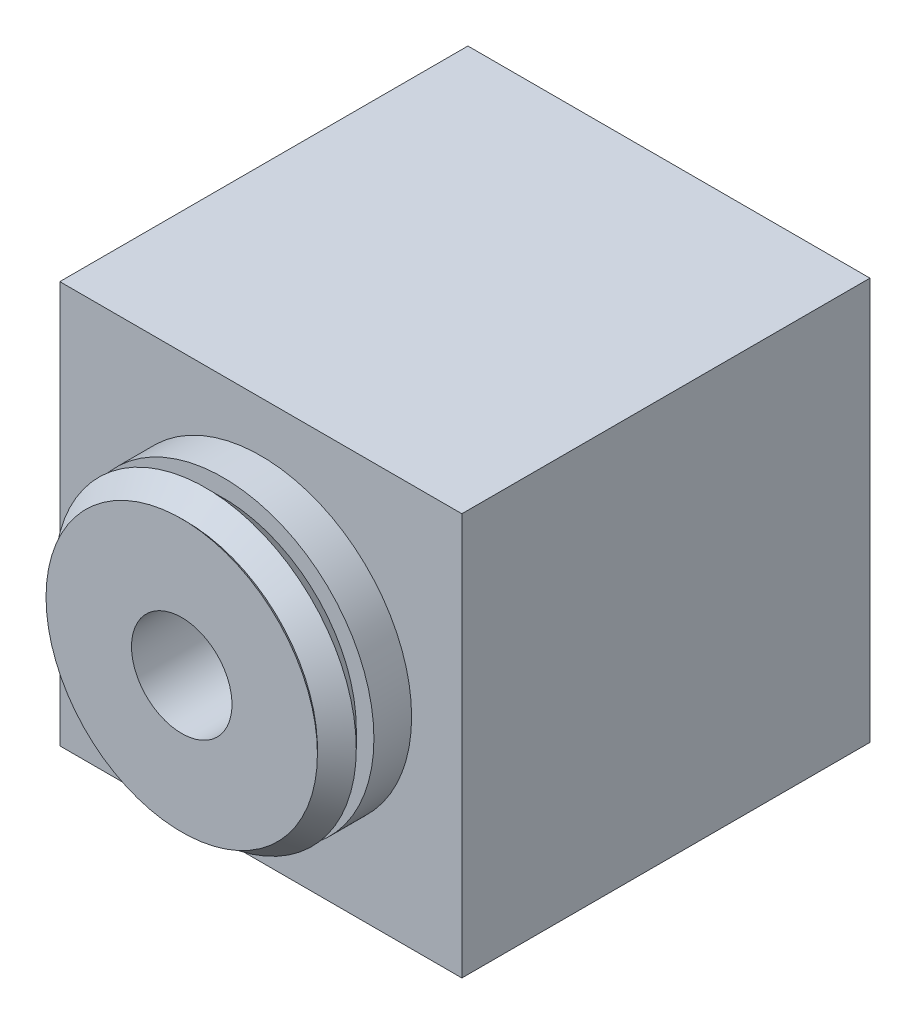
ISO-10303-21;
HEADER;
FILE_DESCRIPTION(('STEP AP214'),'2;1');
FILE_NAME('part.step','',(''),(''),'','','');
FILE_SCHEMA(('AUTOMOTIVE_DESIGN { 1 0 10303 214 1 1 1 1 }'));
ENDSEC;
DATA;
#1=APPLICATION_CONTEXT('core data for automotive mechanical design processes');
#2=APPLICATION_PROTOCOL_DEFINITION('international standard','automotive_design',2000,#1);
#3=PRODUCT_CONTEXT('',#1,'mechanical');
#4=PRODUCT('Part','Part','',(#3));
#5=PRODUCT_RELATED_PRODUCT_CATEGORY('part','',(#4));
#6=PRODUCT_DEFINITION_FORMATION('','',#4);
#7=PRODUCT_DEFINITION_CONTEXT('part definition',#1,'design');
#8=PRODUCT_DEFINITION('design','',#6,#7);
#9=PRODUCT_DEFINITION_SHAPE('','',#8);
#10=(LENGTH_UNIT() NAMED_UNIT(*) SI_UNIT(.MILLI.,.METRE.));
#11=(NAMED_UNIT(*) PLANE_ANGLE_UNIT() SI_UNIT($,.RADIAN.));
#12=(NAMED_UNIT(*) SI_UNIT($,.STERADIAN.) SOLID_ANGLE_UNIT());
#13=UNCERTAINTY_MEASURE_WITH_UNIT(LENGTH_MEASURE(1.E-05),#10,'distance_accuracy_value','');
#14=(GEOMETRIC_REPRESENTATION_CONTEXT(3) GLOBAL_UNCERTAINTY_ASSIGNED_CONTEXT((#13)) GLOBAL_UNIT_ASSIGNED_CONTEXT((#10,
#11,#12)) REPRESENTATION_CONTEXT('',''));
#15=CARTESIAN_POINT('',(0.,0.,0.));
#16=DIRECTION('',(0.,0.,1.));
#17=DIRECTION('',(1.,0.,0.));
#18=AXIS2_PLACEMENT_3D('',#15,#16,#17);
#19=CARTESIAN_POINT('',(0.,0.,0.));
#20=DIRECTION('',(0.,0.,1.));
#21=DIRECTION('',(1.,0.,0.));
#22=AXIS2_PLACEMENT_3D('',#19,#20,#21);
#23=PLANE('',#22);
#24=CARTESIAN_POINT('',(0.,0.,0.));
#25=DIRECTION('',(0.,0.,-1.));
#26=DIRECTION('',(-1.,0.,0.));
#27=AXIS2_PLACEMENT_3D('',#24,#25,#26);
#28=CIRCLE('',#27,6.858);
#29=CARTESIAN_POINT('',(-6.858,0.,0.));
#30=VERTEX_POINT('',#29);
#31=EDGE_CURVE('E11',#30,#30,#28,.T.);
#32=ORIENTED_EDGE('',*,*,#31,.F.);
#33=EDGE_LOOP('',(#32));
#34=FACE_BOUND('',#33,.T.);
#35=CARTESIAN_POINT('',(0.,0.,0.));
#36=DIRECTION('',(0.,0.,-1.));
#37=DIRECTION('',(-1.,0.,0.));
#38=AXIS2_PLACEMENT_3D('',#35,#36,#37);
#39=CIRCLE('',#38,2.54);
#40=CARTESIAN_POINT('',(-2.54,0.,0.));
#41=VERTEX_POINT('',#40);
#42=EDGE_CURVE('E152',#41,#41,#39,.T.);
#43=ORIENTED_EDGE('',*,*,#42,.T.);
#44=EDGE_LOOP('',(#43));
#45=FACE_BOUND('',#44,.T.);
#46=ADVANCED_FACE('F35',(#34,#45),#23,.T.);
#47=CARTESIAN_POINT('',(0.,0.,-26.197814));
#48=DIRECTION('',(0.,0.,-1.));
#49=DIRECTION('',(-1.,0.,0.));
#50=AXIS2_PLACEMENT_3D('',#47,#48,#49);
#51=PLANE('',#50);
#52=CARTESIAN_POINT('',(0.,0.,-26.197814));
#53=DIRECTION('',(0.,0.,-1.));
#54=DIRECTION('',(-1.,0.,0.));
#55=AXIS2_PLACEMENT_3D('',#52,#53,#54);
#56=CIRCLE('',#55,6.35);
#57=CARTESIAN_POINT('',(-6.35,0.,-26.197814));
#58=VERTEX_POINT('',#57);
#59=EDGE_CURVE('E160',#58,#58,#56,.T.);
#60=ORIENTED_EDGE('',*,*,#59,.T.);
#61=EDGE_LOOP('',(#60));
#62=FACE_BOUND('',#61,.T.);
#63=CARTESIAN_POINT('',(0.,0.,-26.197814));
#64=DIRECTION('',(0.,0.,-1.));
#65=DIRECTION('',(-1.,0.,0.));
#66=AXIS2_PLACEMENT_3D('',#63,#64,#65);
#67=CIRCLE('',#66,2.54);
#68=CARTESIAN_POINT('',(-2.54,0.,-26.197814));
#69=VERTEX_POINT('',#68);
#70=EDGE_CURVE('E154',#69,#69,#67,.T.);
#71=ORIENTED_EDGE('',*,*,#70,.F.);
#72=EDGE_LOOP('',(#71));
#73=FACE_BOUND('',#72,.T.);
#74=ADVANCED_FACE('F139',(#62,#73),#51,.T.);
#75=CARTESIAN_POINT('',(10.16,-10.16,-24.623014));
#76=DIRECTION('',(0.,0.,-1.));
#77=DIRECTION('',(-1.,0.,0.));
#78=AXIS2_PLACEMENT_3D('',#75,#76,#77);
#79=PLANE('',#78);
#80=DIRECTION('',(0.,-1.,0.));
#81=VECTOR('',#80,1.);
#82=CARTESIAN_POINT('',(10.16,10.16,-24.623014));
#83=LINE('',#82,#81);
#84=CARTESIAN_POINT('',(10.16,10.16,-24.623014));
#85=VERTEX_POINT('',#84);
#86=CARTESIAN_POINT('',(10.16,-10.16,-24.623014));
#87=VERTEX_POINT('',#86);
#88=EDGE_CURVE('E88',#85,#87,#83,.T.);
#89=ORIENTED_EDGE('',*,*,#88,.T.);
#90=DIRECTION('',(-1.,0.,0.));
#91=VECTOR('',#90,1.);
#92=CARTESIAN_POINT('',(10.16,-10.16,-24.623014));
#93=LINE('',#92,#91);
#94=CARTESIAN_POINT('',(-10.16,-10.16,-24.623014));
#95=VERTEX_POINT('',#94);
#96=EDGE_CURVE('E82',#87,#95,#93,.T.);
#97=ORIENTED_EDGE('',*,*,#96,.T.);
#98=DIRECTION('',(0.,1.,0.));
#99=VECTOR('',#98,1.);
#100=CARTESIAN_POINT('',(-10.16,10.16,-24.623014));
#101=LINE('',#100,#99);
#102=CARTESIAN_POINT('',(-10.16,10.16,-24.623014));
#103=VERTEX_POINT('',#102);
#104=EDGE_CURVE('E86',#95,#103,#101,.T.);
#105=ORIENTED_EDGE('',*,*,#104,.T.);
#106=DIRECTION('',(1.,0.,0.));
#107=VECTOR('',#106,1.);
#108=CARTESIAN_POINT('',(10.16,10.16,-24.623014));
#109=LINE('',#108,#107);
#110=EDGE_CURVE('E51',#103,#85,#109,.T.);
#111=ORIENTED_EDGE('',*,*,#110,.T.);
#112=EDGE_LOOP('',(#89,#97,#105,#111));
#113=FACE_BOUND('',#112,.T.);
#114=CARTESIAN_POINT('',(-6.91950784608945,6.55087633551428,-24.623014));
#115=DIRECTION('',(0.,0.,-1.));
#116=DIRECTION('',(-1.,0.,0.));
#117=AXIS2_PLACEMENT_3D('',#114,#115,#116);
#118=CIRCLE('',#117,1.7272);
#119=CARTESIAN_POINT('',(-8.64670784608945,6.55087633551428,-24.623014));
#120=VERTEX_POINT('',#119);
#121=EDGE_CURVE('E181',#120,#120,#118,.T.);
#122=ORIENTED_EDGE('',*,*,#121,.F.);
#123=EDGE_LOOP('',(#122));
#124=FACE_BOUND('',#123,.T.);
#125=CARTESIAN_POINT('',(6.55087633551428,-6.91950784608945,-24.623014));
#126=DIRECTION('',(0.,0.,-1.));
#127=DIRECTION('',(1.,0.,0.));
#128=AXIS2_PLACEMENT_3D('',#125,#126,#127);
#129=CIRCLE('',#128,1.7272);
#130=CARTESIAN_POINT('',(8.27807633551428,-6.91950784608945,-24.623014));
#131=VERTEX_POINT('',#130);
#132=EDGE_CURVE('E175',#131,#131,#129,.T.);
#133=ORIENTED_EDGE('',*,*,#132,.F.);
#134=EDGE_LOOP('',(#133));
#135=FACE_BOUND('',#134,.T.);
#136=CARTESIAN_POINT('',(0.,0.,-24.623014));
#137=DIRECTION('',(0.,0.,-1.));
#138=DIRECTION('',(-1.,0.,0.));
#139=AXIS2_PLACEMENT_3D('',#136,#137,#138);
#140=CIRCLE('',#139,6.35);
#141=CARTESIAN_POINT('',(-6.35,0.,-24.623014));
#142=VERTEX_POINT('',#141);
#143=EDGE_CURVE('E157',#142,#142,#140,.T.);
#144=ORIENTED_EDGE('',*,*,#143,.F.);
#145=EDGE_LOOP('',(#144));
#146=FACE_BOUND('',#145,.T.);
#147=ADVANCED_FACE('F83',(#113,#124,#135,#146),#79,.T.);
#148=CARTESIAN_POINT('',(0.,0.,-0.219709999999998));
#149=DIRECTION('',(0.,0.,1.));
#150=DIRECTION('',(1.,0.,0.));
#151=AXIS2_PLACEMENT_3D('',#148,#149,#150);
#152=CONICAL_SURFACE('',#151,6.63829,0.785398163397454);
#153=ORIENTED_EDGE('',*,*,#31,.T.);
#154=EDGE_LOOP('',(#153));
#155=FACE_BOUND('',#154,.T.);
#156=CARTESIAN_POINT('',(0.,0.,-0.219709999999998));
#157=DIRECTION('',(0.,0.,-1.));
#158=DIRECTION('',(-1.,0.,0.));
#159=AXIS2_PLACEMENT_3D('',#156,#157,#158);
#160=CIRCLE('',#159,6.63829);
#161=CARTESIAN_POINT('',(-6.63829,0.,-0.219709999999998));
#162=VERTEX_POINT('',#161);
#163=EDGE_CURVE('E43',#162,#162,#160,.T.);
#164=ORIENTED_EDGE('',*,*,#163,.F.);
#165=EDGE_LOOP('',(#164));
#166=FACE_BOUND('',#165,.T.);
#167=ADVANCED_FACE('F130',(#155,#166),#152,.T.);
#168=CARTESIAN_POINT('',(0.,0.,-1.20141999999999));
#169=DIRECTION('',(0.,0.,-1.));
#170=DIRECTION('',(-1.,0.,0.));
#171=AXIS2_PLACEMENT_3D('',#168,#169,#170);
#172=CONICAL_SURFACE('',#171,7.61999999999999,0.785398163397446);
#173=ORIENTED_EDGE('',*,*,#163,.T.);
#174=EDGE_LOOP('',(#173));
#175=FACE_BOUND('',#174,.T.);
#176=CARTESIAN_POINT('',(0.,0.,-1.20141999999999));
#177=DIRECTION('',(0.,0.,-1.));
#178=DIRECTION('',(-1.,0.,0.));
#179=AXIS2_PLACEMENT_3D('',#176,#177,#178);
#180=CIRCLE('',#179,7.61999999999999);
#181=CARTESIAN_POINT('',(-7.61999999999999,0.,-1.20141999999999));
#182=VERTEX_POINT('',#181);
#183=EDGE_CURVE('E122',#182,#182,#180,.T.);
#184=ORIENTED_EDGE('',*,*,#183,.F.);
#185=EDGE_LOOP('',(#184));
#186=FACE_BOUND('',#185,.T.);
#187=ADVANCED_FACE('F127',(#175,#186),#172,.T.);
#188=CARTESIAN_POINT('',(0.,0.,-2.093214));
#189=DIRECTION('',(0.,0.,1.));
#190=DIRECTION('',(1.,0.,0.));
#191=AXIS2_PLACEMENT_3D('',#188,#189,#190);
#192=CONICAL_SURFACE('',#191,6.72820599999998,0.785398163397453);
#193=ORIENTED_EDGE('',*,*,#183,.T.);
#194=EDGE_LOOP('',(#193));
#195=FACE_BOUND('',#194,.T.);
#196=CARTESIAN_POINT('',(0.,0.,-2.093214));
#197=DIRECTION('',(0.,0.,-1.));
#198=DIRECTION('',(-1.,0.,0.));
#199=AXIS2_PLACEMENT_3D('',#196,#197,#198);
#200=CIRCLE('',#199,6.72820599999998);
#201=CARTESIAN_POINT('',(-6.72820599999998,0.,-2.093214));
#202=VERTEX_POINT('',#201);
#203=EDGE_CURVE('E119',#202,#202,#200,.T.);
#204=ORIENTED_EDGE('',*,*,#203,.F.);
#205=EDGE_LOOP('',(#204));
#206=FACE_BOUND('',#205,.T.);
#207=ADVANCED_FACE('F137',(#195,#206),#192,.T.);
#208=CARTESIAN_POINT('',(0.,6.72820599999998,-2.093214));
#209=DIRECTION('',(0.,0.,1.));
#210=DIRECTION('',(1.,0.,0.));
#211=AXIS2_PLACEMENT_3D('',#208,#209,#210);
#212=PLANE('',#211);
#213=ORIENTED_EDGE('',*,*,#203,.T.);
#214=EDGE_LOOP('',(#213));
#215=FACE_BOUND('',#214,.T.);
#216=CARTESIAN_POINT('',(0.,0.,-2.093214));
#217=DIRECTION('',(0.,0.,-1.));
#218=DIRECTION('',(-1.,0.,0.));
#219=AXIS2_PLACEMENT_3D('',#216,#217,#218);
#220=CIRCLE('',#219,7.61999999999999);
#221=CARTESIAN_POINT('',(-7.61999999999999,0.,-2.093214));
#222=VERTEX_POINT('',#221);
#223=EDGE_CURVE('E116',#222,#222,#220,.T.);
#224=ORIENTED_EDGE('',*,*,#223,.F.);
#225=EDGE_LOOP('',(#224));
#226=FACE_BOUND('',#225,.T.);
#227=ADVANCED_FACE('F257',(#215,#226),#212,.T.);
#228=CARTESIAN_POINT('',(0.,0.,-71.2941240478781));
#229=DIRECTION('',(0.,0.,-1.));
#230=DIRECTION('',(-1.,0.,0.));
#231=AXIS2_PLACEMENT_3D('',#228,#229,#230);
#232=CYLINDRICAL_SURFACE('',#231,7.61999999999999);
#233=ORIENTED_EDGE('',*,*,#223,.T.);
#234=EDGE_LOOP('',(#233));
#235=FACE_BOUND('',#234,.T.);
#236=CARTESIAN_POINT('',(0.,0.,-3.998214));
#237=DIRECTION('',(0.,0.,-1.));
#238=DIRECTION('',(-1.,0.,0.));
#239=AXIS2_PLACEMENT_3D('',#236,#237,#238);
#240=CIRCLE('',#239,7.61999999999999);
#241=CARTESIAN_POINT('',(-7.61999999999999,0.,-3.998214));
#242=VERTEX_POINT('',#241);
#243=EDGE_CURVE('E113',#242,#242,#240,.T.);
#244=ORIENTED_EDGE('',*,*,#243,.F.);
#245=EDGE_LOOP('',(#244));
#246=FACE_BOUND('',#245,.T.);
#247=ADVANCED_FACE('F253',(#235,#246),#232,.T.);
#248=CARTESIAN_POINT('',(10.16,10.16,-24.623014));
#249=DIRECTION('',(-1.,0.,0.));
#250=DIRECTION('',(0.,0.,1.));
#251=AXIS2_PLACEMENT_3D('',#248,#249,#250);
#252=PLANE('',#251);
#253=DIRECTION('',(0.,-1.,0.));
#254=VECTOR('',#253,1.);
#255=CARTESIAN_POINT('',(10.16,10.16,-3.998214));
#256=LINE('',#255,#254);
#257=CARTESIAN_POINT('',(10.16,10.16,-3.998214));
#258=VERTEX_POINT('',#257);
#259=CARTESIAN_POINT('',(10.16,-10.16,-3.998214));
#260=VERTEX_POINT('',#259);
#261=EDGE_CURVE('E103',#258,#260,#256,.T.);
#262=ORIENTED_EDGE('',*,*,#261,.T.);
#263=DIRECTION('',(0.,0.,1.));
#264=VECTOR('',#263,1.);
#265=CARTESIAN_POINT('',(10.16,-10.16,-24.623014));
#266=LINE('',#265,#264);
#267=EDGE_CURVE('E94',#87,#260,#266,.T.);
#268=ORIENTED_EDGE('',*,*,#267,.F.);
#269=ORIENTED_EDGE('',*,*,#88,.F.);
#270=DIRECTION('',(0.,0.,1.));
#271=VECTOR('',#270,1.);
#272=CARTESIAN_POINT('',(10.16,10.16,-24.623014));
#273=LINE('',#272,#271);
#274=EDGE_CURVE('E99',#85,#258,#273,.T.);
#275=ORIENTED_EDGE('',*,*,#274,.T.);
#276=EDGE_LOOP('',(#262,#268,#269,#275));
#277=FACE_BOUND('',#276,.T.);
#278=ADVANCED_FACE('F250',(#277),#252,.F.);
#279=CARTESIAN_POINT('',(10.16,-10.16,-24.623014));
#280=DIRECTION('',(0.,1.,0.));
#281=DIRECTION('',(0.,0.,1.));
#282=AXIS2_PLACEMENT_3D('',#279,#280,#281);
#283=PLANE('',#282);
#284=DIRECTION('',(-1.,0.,0.));
#285=VECTOR('',#284,1.);
#286=CARTESIAN_POINT('',(10.16,-10.16,-3.998214));
#287=LINE('',#286,#285);
#288=CARTESIAN_POINT('',(-10.16,-10.16,-3.998214));
#289=VERTEX_POINT('',#288);
#290=EDGE_CURVE('E93',#260,#289,#287,.T.);
#291=ORIENTED_EDGE('',*,*,#290,.T.);
#292=DIRECTION('',(0.,0.,1.));
#293=VECTOR('',#292,1.);
#294=CARTESIAN_POINT('',(-10.16,-10.16,-24.623014));
#295=LINE('',#294,#293);
#296=EDGE_CURVE('E91',#95,#289,#295,.T.);
#297=ORIENTED_EDGE('',*,*,#296,.F.);
#298=ORIENTED_EDGE('',*,*,#96,.F.);
#299=ORIENTED_EDGE('',*,*,#267,.T.);
#300=EDGE_LOOP('',(#291,#297,#298,#299));
#301=FACE_BOUND('',#300,.T.);
#302=ADVANCED_FACE('F92',(#301),#283,.F.);
#303=CARTESIAN_POINT('',(-10.16,10.16,-24.623014));
#304=DIRECTION('',(1.,0.,0.));
#305=DIRECTION('',(0.,1.,0.));
#306=AXIS2_PLACEMENT_3D('',#303,#304,#305);
#307=PLANE('',#306);
#308=CARTESIAN_POINT('',(-10.16,-5.5499,-18.273014));
#309=DIRECTION('',(-1.,0.,0.));
#310=DIRECTION('',(0.,-1.,0.));
#311=AXIS2_PLACEMENT_3D('',#308,#309,#310);
#312=CIRCLE('',#311,1.7272);
#313=CARTESIAN_POINT('',(-10.16,-7.2771,-18.273014));
#314=VERTEX_POINT('',#313);
#315=EDGE_CURVE('E163',#314,#314,#312,.T.);
#316=ORIENTED_EDGE('',*,*,#315,.F.);
#317=EDGE_LOOP('',(#316));
#318=FACE_BOUND('',#317,.T.);
#319=CARTESIAN_POINT('',(-10.16,5.5499,-7.17321400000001));
#320=DIRECTION('',(-1.,0.,0.));
#321=DIRECTION('',(0.,-1.,0.));
#322=AXIS2_PLACEMENT_3D('',#319,#320,#321);
#323=CIRCLE('',#322,1.7272);
#324=CARTESIAN_POINT('',(-10.16,3.8227,-7.17321400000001));
#325=VERTEX_POINT('',#324);
#326=EDGE_CURVE('E169',#325,#325,#323,.T.);
#327=ORIENTED_EDGE('',*,*,#326,.F.);
#328=EDGE_LOOP('',(#327));
#329=FACE_BOUND('',#328,.T.);
#330=DIRECTION('',(0.,1.,0.));
#331=VECTOR('',#330,1.);
#332=CARTESIAN_POINT('',(-10.16,10.16,-3.998214));
#333=LINE('',#332,#331);
#334=CARTESIAN_POINT('',(-10.16,10.16,-3.998214));
#335=VERTEX_POINT('',#334);
#336=EDGE_CURVE('E68',#289,#335,#333,.T.);
#337=ORIENTED_EDGE('',*,*,#336,.T.);
#338=DIRECTION('',(0.,0.,1.));
#339=VECTOR('',#338,1.);
#340=CARTESIAN_POINT('',(-10.16,10.16,-24.623014));
#341=LINE('',#340,#339);
#342=EDGE_CURVE('E95',#103,#335,#341,.T.);
#343=ORIENTED_EDGE('',*,*,#342,.F.);
#344=ORIENTED_EDGE('',*,*,#104,.F.);
#345=ORIENTED_EDGE('',*,*,#296,.T.);
#346=EDGE_LOOP('',(#337,#343,#344,#345));
#347=FACE_BOUND('',#346,.T.);
#348=ADVANCED_FACE('F97',(#318,#329,#347),#307,.F.);
#349=CARTESIAN_POINT('',(10.16,10.16,-24.623014));
#350=DIRECTION('',(0.,-1.,0.));
#351=DIRECTION('',(0.,0.,-1.));
#352=AXIS2_PLACEMENT_3D('',#349,#350,#351);
#353=PLANE('',#352);
#354=DIRECTION('',(1.,0.,0.));
#355=VECTOR('',#354,1.);
#356=CARTESIAN_POINT('',(10.16,10.16,-3.998214));
#357=LINE('',#356,#355);
#358=EDGE_CURVE('E74',#335,#258,#357,.T.);
#359=ORIENTED_EDGE('',*,*,#358,.T.);
#360=ORIENTED_EDGE('',*,*,#274,.F.);
#361=ORIENTED_EDGE('',*,*,#110,.F.);
#362=ORIENTED_EDGE('',*,*,#342,.T.);
#363=EDGE_LOOP('',(#359,#360,#361,#362));
#364=FACE_BOUND('',#363,.T.);
#365=ADVANCED_FACE('F241',(#364),#353,.F.);
#366=CARTESIAN_POINT('',(10.16,-10.16,-3.998214));
#367=DIRECTION('',(0.,0.,-1.));
#368=DIRECTION('',(-1.,0.,0.));
#369=AXIS2_PLACEMENT_3D('',#366,#367,#368);
#370=PLANE('',#369);
#371=ORIENTED_EDGE('',*,*,#243,.T.);
#372=EDGE_LOOP('',(#371));
#373=FACE_BOUND('',#372,.T.);
#374=ORIENTED_EDGE('',*,*,#261,.F.);
#375=ORIENTED_EDGE('',*,*,#358,.F.);
#376=ORIENTED_EDGE('',*,*,#336,.F.);
#377=ORIENTED_EDGE('',*,*,#290,.F.);
#378=EDGE_LOOP('',(#374,#375,#376,#377));
#379=FACE_BOUND('',#378,.T.);
#380=ADVANCED_FACE('F236',(#373,#379),#370,.F.);
#381=CARTESIAN_POINT('',(-6.91950784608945,6.55087633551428,-16.698214));
#382=DIRECTION('',(0.,0.,-1.));
#383=DIRECTION('',(-1.,0.,0.));
#384=AXIS2_PLACEMENT_3D('',#381,#382,#383);
#385=CYLINDRICAL_SURFACE('',#384,1.7272);
#386=CARTESIAN_POINT('',(-6.91950784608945,6.55087633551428,-16.698214));
#387=DIRECTION('',(0.,0.,-1.));
#388=DIRECTION('',(-1.,0.,0.));
#389=AXIS2_PLACEMENT_3D('',#386,#387,#388);
#390=CIRCLE('',#389,1.7272);
#391=CARTESIAN_POINT('',(-8.64670784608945,6.55087633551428,-16.698214));
#392=VERTEX_POINT('',#391);
#393=EDGE_CURVE('E106',#392,#392,#390,.T.);
#394=ORIENTED_EDGE('',*,*,#393,.F.);
#395=EDGE_LOOP('',(#394));
#396=FACE_BOUND('',#395,.T.);
#397=ORIENTED_EDGE('',*,*,#121,.T.);
#398=EDGE_LOOP('',(#397));
#399=FACE_BOUND('',#398,.T.);
#400=ADVANCED_FACE('F189',(#396,#399),#385,.F.);
#401=CARTESIAN_POINT('',(-6.91950784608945,6.55087633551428,-16.698214));
#402=DIRECTION('',(0.,0.,-1.));
#403=DIRECTION('',(-1.,0.,0.));
#404=AXIS2_PLACEMENT_3D('',#401,#402,#403);
#405=PLANE('',#404);
#406=ORIENTED_EDGE('',*,*,#393,.T.);
#407=EDGE_LOOP('',(#406));
#408=FACE_BOUND('',#407,.T.);
#409=ADVANCED_FACE('F230',(#408),#405,.T.);
#410=CARTESIAN_POINT('',(6.55087633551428,-6.91950784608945,-16.698214));
#411=DIRECTION('',(0.,0.,-1.));
#412=DIRECTION('',(-1.,0.,0.));
#413=AXIS2_PLACEMENT_3D('',#410,#411,#412);
#414=CYLINDRICAL_SURFACE('',#413,1.7272);
#415=CARTESIAN_POINT('',(6.55087633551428,-6.91950784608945,-16.698214));
#416=DIRECTION('',(0.,0.,-1.));
#417=DIRECTION('',(1.,0.,0.));
#418=AXIS2_PLACEMENT_3D('',#415,#416,#417);
#419=CIRCLE('',#418,1.7272);
#420=CARTESIAN_POINT('',(8.27807633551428,-6.91950784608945,-16.698214));
#421=VERTEX_POINT('',#420);
#422=EDGE_CURVE('E178',#421,#421,#419,.T.);
#423=ORIENTED_EDGE('',*,*,#422,.F.);
#424=EDGE_LOOP('',(#423));
#425=FACE_BOUND('',#424,.T.);
#426=ORIENTED_EDGE('',*,*,#132,.T.);
#427=EDGE_LOOP('',(#426));
#428=FACE_BOUND('',#427,.T.);
#429=ADVANCED_FACE('F226',(#425,#428),#414,.F.);
#430=CARTESIAN_POINT('',(6.55087633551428,-6.91950784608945,-16.698214));
#431=DIRECTION('',(0.,0.,1.));
#432=DIRECTION('',(1.,0.,0.));
#433=AXIS2_PLACEMENT_3D('',#430,#431,#432);
#434=PLANE('',#433);
#435=ORIENTED_EDGE('',*,*,#422,.T.);
#436=EDGE_LOOP('',(#435));
#437=FACE_BOUND('',#436,.T.);
#438=ADVANCED_FACE('F222',(#437),#434,.F.);
#439=CARTESIAN_POINT('',(-5.4102,5.5499,-7.17321400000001));
#440=DIRECTION('',(-1.,0.,0.));
#441=DIRECTION('',(0.,-1.,0.));
#442=AXIS2_PLACEMENT_3D('',#439,#440,#441);
#443=CYLINDRICAL_SURFACE('',#442,1.7272);
#444=CARTESIAN_POINT('',(-5.4102,5.5499,-7.17321400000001));
#445=DIRECTION('',(-1.,0.,0.));
#446=DIRECTION('',(0.,-1.,0.));
#447=AXIS2_PLACEMENT_3D('',#444,#445,#446);
#448=CIRCLE('',#447,1.7272);
#449=CARTESIAN_POINT('',(-5.4102,3.8227,-7.17321400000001));
#450=VERTEX_POINT('',#449);
#451=EDGE_CURVE('E172',#450,#450,#448,.T.);
#452=ORIENTED_EDGE('',*,*,#451,.F.);
#453=EDGE_LOOP('',(#452));
#454=FACE_BOUND('',#453,.T.);
#455=ORIENTED_EDGE('',*,*,#326,.T.);
#456=EDGE_LOOP('',(#455));
#457=FACE_BOUND('',#456,.T.);
#458=ADVANCED_FACE('F218',(#454,#457),#443,.F.);
#459=CARTESIAN_POINT('',(-5.4102,5.5499,-7.17321400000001));
#460=DIRECTION('',(-1.,0.,0.));
#461=DIRECTION('',(0.,-1.,0.));
#462=AXIS2_PLACEMENT_3D('',#459,#460,#461);
#463=PLANE('',#462);
#464=ORIENTED_EDGE('',*,*,#451,.T.);
#465=EDGE_LOOP('',(#464));
#466=FACE_BOUND('',#465,.T.);
#467=ADVANCED_FACE('F214',(#466),#463,.T.);
#468=CARTESIAN_POINT('',(-5.4102,-5.5499,-18.273014));
#469=DIRECTION('',(-1.,0.,0.));
#470=DIRECTION('',(0.,-1.,0.));
#471=AXIS2_PLACEMENT_3D('',#468,#469,#470);
#472=CYLINDRICAL_SURFACE('',#471,1.7272);
#473=CARTESIAN_POINT('',(-5.4102,-5.5499,-18.273014));
#474=DIRECTION('',(-1.,0.,0.));
#475=DIRECTION('',(0.,-1.,0.));
#476=AXIS2_PLACEMENT_3D('',#473,#474,#475);
#477=CIRCLE('',#476,1.7272);
#478=CARTESIAN_POINT('',(-5.4102,-7.2771,-18.273014));
#479=VERTEX_POINT('',#478);
#480=EDGE_CURVE('E166',#479,#479,#477,.T.);
#481=ORIENTED_EDGE('',*,*,#480,.F.);
#482=EDGE_LOOP('',(#481));
#483=FACE_BOUND('',#482,.T.);
#484=ORIENTED_EDGE('',*,*,#315,.T.);
#485=EDGE_LOOP('',(#484));
#486=FACE_BOUND('',#485,.T.);
#487=ADVANCED_FACE('F207',(#483,#486),#472,.F.);
#488=CARTESIAN_POINT('',(-5.4102,-5.5499,-18.273014));
#489=DIRECTION('',(-1.,0.,0.));
#490=DIRECTION('',(0.,-1.,0.));
#491=AXIS2_PLACEMENT_3D('',#488,#489,#490);
#492=PLANE('',#491);
#493=ORIENTED_EDGE('',*,*,#480,.T.);
#494=EDGE_LOOP('',(#493));
#495=FACE_BOUND('',#494,.T.);
#496=ADVANCED_FACE('F198',(#495),#492,.T.);
#497=CARTESIAN_POINT('',(0.,0.,-26.197814));
#498=DIRECTION('',(0.,0.,1.));
#499=DIRECTION('',(1.,0.,0.));
#500=AXIS2_PLACEMENT_3D('',#497,#498,#499);
#501=CYLINDRICAL_SURFACE('',#500,6.35);
#502=ORIENTED_EDGE('',*,*,#59,.F.);
#503=EDGE_LOOP('',(#502));
#504=FACE_BOUND('',#503,.T.);
#505=ORIENTED_EDGE('',*,*,#143,.T.);
#506=EDGE_LOOP('',(#505));
#507=FACE_BOUND('',#506,.T.);
#508=ADVANCED_FACE('F195',(#504,#507),#501,.T.);
#509=CARTESIAN_POINT('',(0.,0.,-26.197814));
#510=DIRECTION('',(0.,0.,1.));
#511=DIRECTION('',(1.,0.,0.));
#512=AXIS2_PLACEMENT_3D('',#509,#510,#511);
#513=CYLINDRICAL_SURFACE('',#512,2.54);
#514=ORIENTED_EDGE('',*,*,#70,.T.);
#515=EDGE_LOOP('',(#514));
#516=FACE_BOUND('',#515,.T.);
#517=ORIENTED_EDGE('',*,*,#42,.F.);
#518=EDGE_LOOP('',(#517));
#519=FACE_BOUND('',#518,.T.);
#520=ADVANCED_FACE('F197',(#516,#519),#513,.F.);
#521=CLOSED_SHELL('',(#46,#74,#147,#167,#187,#207,#227,#247,#278,#302,#348,#365,#380,#400,#409,
#429,#438,#458,#467,#487,#496,#508,#520));
#522=MANIFOLD_SOLID_BREP('B2',#521);
#523=ADVANCED_BREP_SHAPE_REPRESENTATION('',(#18,#522),#14);
#524=SHAPE_DEFINITION_REPRESENTATION(#9,#523);
ENDSEC;
END-ISO-10303-21;
